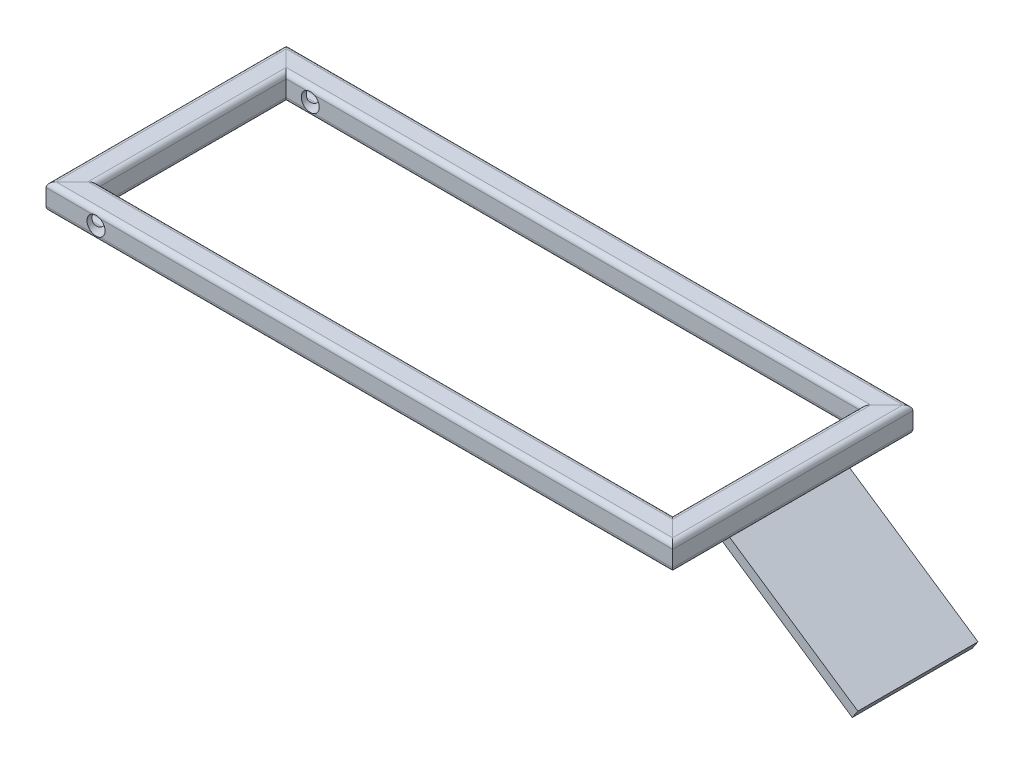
from build123d import *

# Parameters (mm, degrees)
ROUND_EDGE_13_X_13_X_2_5_1_DEPTH      = 310.192388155
ROUND_EDGE_13_X_13_X_2_5_1_DEPTH_BACK = 10.192388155
ROUND_EDGE_13_X_13_X_2_5_1_2_DEPTH    = 127.384776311
ROUND_EDGE_13_X_13_X_2_5_1_3_DEPTH    = 320.384776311
ROUND_EDGE_13_X_13_X_2_5_1_4_DEPTH    = 127.384776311
CUT_EXTRUDE1_DEPTH                    = 168.733419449
CUT_EXTRUDE1_DEPTH_BACK               = 168.733419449
SKETCH12_R                            = 4.5
BOSS_EXTRUDE1_DEPTH                   = 30


with BuildPart() as part:
    # Sketch11 → Round edge 13 X 13 X 2.5_1 (new, two sides: drawn at the far end of the back side and taken through both)
    with BuildSketch(Plane(origin=(-150, 0, -53.5), x_dir=(0, 0, -1), z_dir=(1, 0, 0)).offset(-ROUND_EDGE_13_X_13_X_2_5_1_DEPTH_BACK)):
        with BuildLine():
            Line((-4, 6.5), (4, 6.5))
            ThreePointArc((4, 6.5), (5.767766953, 5.767766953), (6.5, 4))
            Line((6.5, 4), (6.5, -4))
            ThreePointArc((6.5, -4), (5.767766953, -5.767766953), (4, -6.5))
            Line((4, -6.5), (-4, -6.5))
            ThreePointArc((-4, -6.5), (-5.767766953, -5.767766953), (-6.5, -4))
            Line((-6.5, -4), (-6.5, 4))
            ThreePointArc((-6.5, 4), (-5.767766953, 5.767766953), (-4, 6.5))
        make_face()
        with BuildLine():
            Line((-1.5, 4), (1.5, 4))
            ThreePointArc((1.5, 4), (3.267766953, 3.267766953), (4, 1.5))
            Line((4, 1.5), (4, -1.5))
            ThreePointArc((4, -1.5), (3.267766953, -3.267766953), (1.5, -4))
            Line((1.5, -4), (-1.5, -4))
            ThreePointArc((-1.5, -4), (-3.267766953, -3.267766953), (-4, -1.5))
            Line((-4, -1.5), (-4, 1.5))
            ThreePointArc((-4, 1.5), (-3.267766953, 3.267766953), (-1.5, 4))
        make_face(mode=Mode.SUBTRACT)
    extrude(amount=ROUND_EDGE_13_X_13_X_2_5_1_DEPTH + ROUND_EDGE_13_X_13_X_2_5_1_DEPTH_BACK)

    # Round edge 13 X 13 X 2.5_1 mitre 1
    split(bisect_by=Plane(origin=(-150, 0, -53.5), x_dir=(0, 1, 0), z_dir=(0.707106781, 0, -0.707106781)), keep=Keep.TOP)

    # Round edge 13 X 13 X 2.5_1 mitre 2
    split(bisect_by=Plane(origin=(150, 0, -53.5), x_dir=(0, -1, 0), z_dir=(-0.707106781, 0, -0.707106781)), keep=Keep.TOP)


with BuildPart() as body_2:
    # Sketch11 on segment 2 (on carried to segment 2) → Round edge 13 X 13 X 2.5_1 2 (new body)
    with BuildSketch(Plane(origin=(150, 0, -63.692388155), x_dir=(1, 0, 0), z_dir=(0, 0, 1))):
        with BuildLine():
            Line((-4, 6.5), (4, 6.5))
            ThreePointArc((4, 6.5), (5.767766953, 5.767766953), (6.5, 4))
            Line((6.5, 4), (6.5, -4))
            ThreePointArc((6.5, -4), (5.767766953, -5.767766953), (4, -6.5))
            Line((4, -6.5), (-4, -6.5))
            ThreePointArc((-4, -6.5), (-5.767766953, -5.767766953), (-6.5, -4))
            Line((-6.5, -4), (-6.5, 4))
            ThreePointArc((-6.5, 4), (-5.767766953, 5.767766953), (-4, 6.5))
        make_face()
        with BuildLine():
            Line((-1.5, 4), (1.5, 4))
            ThreePointArc((1.5, 4), (3.267766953, 3.267766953), (4, 1.5))
            Line((4, 1.5), (4, -1.5))
            ThreePointArc((4, -1.5), (3.267766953, -3.267766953), (1.5, -4))
            Line((1.5, -4), (-1.5, -4))
            ThreePointArc((-1.5, -4), (-3.267766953, -3.267766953), (-4, -1.5))
            Line((-4, -1.5), (-4, 1.5))
            ThreePointArc((-4, 1.5), (-3.267766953, 3.267766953), (-1.5, 4))
        make_face(mode=Mode.SUBTRACT)
    extrude(amount=ROUND_EDGE_13_X_13_X_2_5_1_2_DEPTH)

    # Round edge 13 X 13 X 2.5_1 2 mitre 1
    split(bisect_by=Plane(origin=(150, 0, -53.5), x_dir=(0, 1, 0), z_dir=(0.707106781, 0, 0.707106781)), keep=Keep.TOP)

    # Round edge 13 X 13 X 2.5_1 2 mitre 2
    split(bisect_by=Plane(origin=(150, 0, 53.5), x_dir=(0, 1, 0), z_dir=(0.707106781, 0, -0.707106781)), keep=Keep.TOP)


with BuildPart() as body_3:
    # Sketch11 on segment 3 (on carried to segment 3) → Round edge 13 X 13 X 2.5_1 3 (new body)
    with BuildSketch(Plane(origin=(160.192388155, 0, 53.5), x_dir=(0, 0, 1), z_dir=(-1, 0, 0))):
        with BuildLine():
            Line((-4, 6.5), (4, 6.5))
            ThreePointArc((4, 6.5), (5.767766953, 5.767766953), (6.5, 4))
            Line((6.5, 4), (6.5, -4))
            ThreePointArc((6.5, -4), (5.767766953, -5.767766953), (4, -6.5))
            Line((4, -6.5), (-4, -6.5))
            ThreePointArc((-4, -6.5), (-5.767766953, -5.767766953), (-6.5, -4))
            Line((-6.5, -4), (-6.5, 4))
            ThreePointArc((-6.5, 4), (-5.767766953, 5.767766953), (-4, 6.5))
        make_face()
        with BuildLine():
            Line((-1.5, 4), (1.5, 4))
            ThreePointArc((1.5, 4), (3.267766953, 3.267766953), (4, 1.5))
            Line((4, 1.5), (4, -1.5))
            ThreePointArc((4, -1.5), (3.267766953, -3.267766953), (1.5, -4))
            Line((1.5, -4), (-1.5, -4))
            ThreePointArc((-1.5, -4), (-3.267766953, -3.267766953), (-4, -1.5))
            Line((-4, -1.5), (-4, 1.5))
            ThreePointArc((-4, 1.5), (-3.267766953, 3.267766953), (-1.5, 4))
        make_face(mode=Mode.SUBTRACT)
    extrude(amount=ROUND_EDGE_13_X_13_X_2_5_1_3_DEPTH)

    # Round edge 13 X 13 X 2.5_1 3 mitre 1
    split(bisect_by=Plane(origin=(-150, 0, 53.5), x_dir=(0, 1, 0), z_dir=(0.707106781, 0, 0.707106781)), keep=Keep.TOP)

    # Round edge 13 X 13 X 2.5_1 3 mitre 2
    split(bisect_by=Plane(origin=(150, 0, 53.5), x_dir=(0, -1, 0), z_dir=(-0.707106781, 0, 0.707106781)), keep=Keep.TOP)


with BuildPart() as body_4:
    # Sketch11 on segment 4 (on carried to segment 4) → Round edge 13 X 13 X 2.5_1 4 (new body)
    with BuildSketch(Plane(origin=(-150, 0, 63.692388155), x_dir=(-1, 0, 0), z_dir=(0, 0, -1))):
        with BuildLine():
            Line((-4, 6.5), (4, 6.5))
            ThreePointArc((4, 6.5), (5.767766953, 5.767766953), (6.5, 4))
            Line((6.5, 4), (6.5, -4))
            ThreePointArc((6.5, -4), (5.767766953, -5.767766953), (4, -6.5))
            Line((4, -6.5), (-4, -6.5))
            ThreePointArc((-4, -6.5), (-5.767766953, -5.767766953), (-6.5, -4))
            Line((-6.5, -4), (-6.5, 4))
            ThreePointArc((-6.5, 4), (-5.767766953, 5.767766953), (-4, 6.5))
        make_face()
        with BuildLine():
            Line((-1.5, 4), (1.5, 4))
            ThreePointArc((1.5, 4), (3.267766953, 3.267766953), (4, 1.5))
            Line((4, 1.5), (4, -1.5))
            ThreePointArc((4, -1.5), (3.267766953, -3.267766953), (1.5, -4))
            Line((1.5, -4), (-1.5, -4))
            ThreePointArc((-1.5, -4), (-3.267766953, -3.267766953), (-4, -1.5))
            Line((-4, -1.5), (-4, 1.5))
            ThreePointArc((-4, 1.5), (-3.267766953, 3.267766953), (-1.5, 4))
        make_face(mode=Mode.SUBTRACT)
    extrude(amount=ROUND_EDGE_13_X_13_X_2_5_1_4_DEPTH)

    # Round edge 13 X 13 X 2.5_1 4 mitre 1
    split(bisect_by=Plane(origin=(-150, 0, -53.5), x_dir=(0, -1, 0), z_dir=(-0.707106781, 0, 0.707106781)), keep=Keep.TOP)

    # Round edge 13 X 13 X 2.5_1 4 mitre 2
    split(bisect_by=Plane(origin=(-150, 0, 53.5), x_dir=(0, -1, 0), z_dir=(-0.707106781, 0, -0.707106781)), keep=Keep.TOP)


with BuildPart() as cut_extrude1_tool:
    # Sketch12 → Cut-Extrude1 (new, two sides: drawn at the far end of the back side and taken through both)
    with BuildSketch(Plane.XY.offset(-CUT_EXTRUDE1_DEPTH_BACK)):
        with Locations(Location((-131.5, 0, 0), (0, 0, 297.266044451))):
            Circle(SKETCH12_R)
    extrude(amount=CUT_EXTRUDE1_DEPTH + CUT_EXTRUDE1_DEPTH_BACK)


with BuildPart() as part_1:
    add(part.part)

    # Cut-Extrude1: cut by cut_extrude1_tool
    add(cut_extrude1_tool.part, mode=Mode.SUBTRACT)


with BuildPart() as body_3_1:
    add(body_3.part)

    # Cut-Extrude1: cut by cut_extrude1_tool
    add(cut_extrude1_tool.part, mode=Mode.SUBTRACT)


with BuildPart() as body_5:
    # Sketch13 → Boss-Extrude1 (new, symmetric)
    with BuildSketch(Plane.XY):
        Polygon((146, -6.5), (216.236063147, -53.874822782), (219.032027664, -49.729634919), (154.94145825, -6.5), align=None)
    extrude(amount=BOSS_EXTRUDE1_DEPTH, both=True)


solid = Compound([body_2.part, body_4.part, part_1.part, body_3_1.part, body_5.part])
